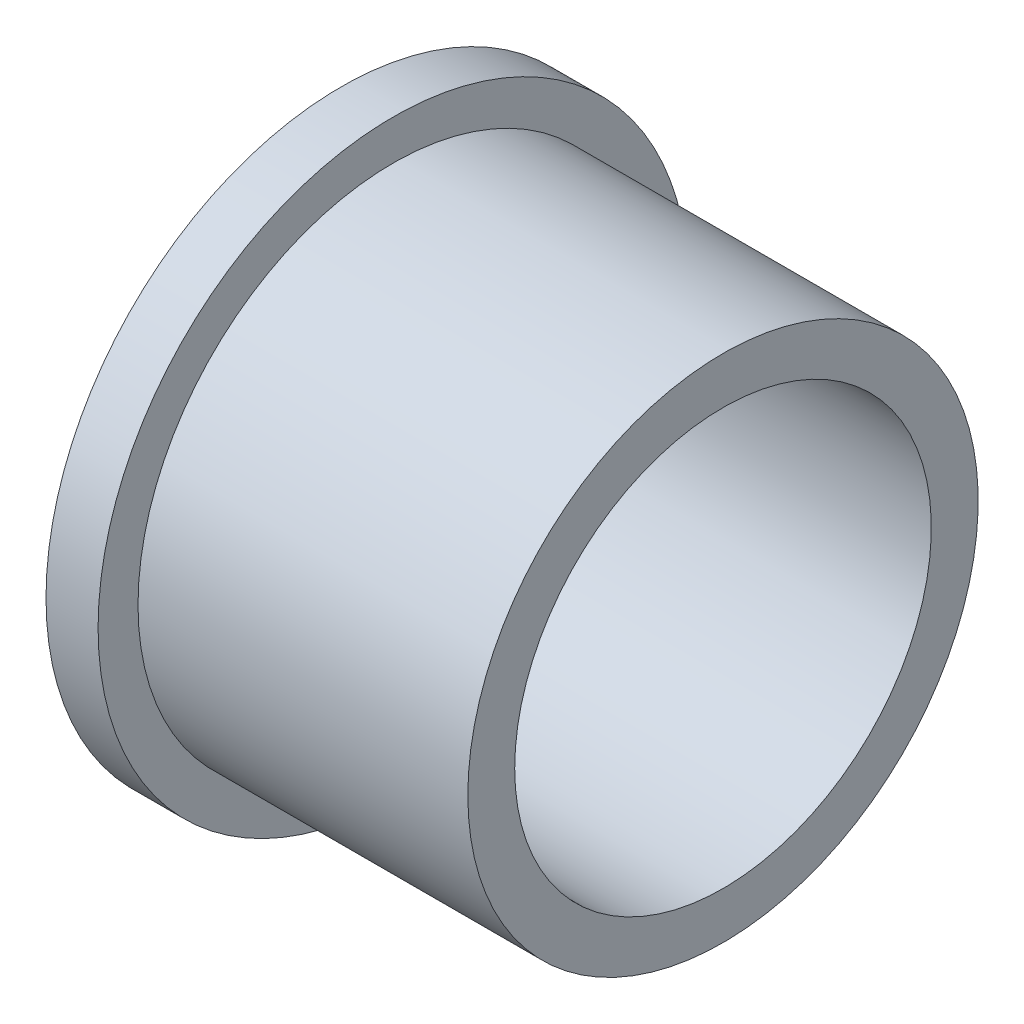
from build123d import *


with BuildPart() as part:
    # Sketch1 → Revolve1 (revolve)
    with BuildSketch(Plane.XY, mode=Mode.PRIVATE) as revolve1_sk:
        Polygon((-1.5, 6), (9.5, 6), (9.5, 7.35), (0, 7.35), (0, 8.5), (-1.5, 8.5), align=None)
    revolve(revolve1_sk.sketch.rotate(Axis((0, 0, 0), (1, 0, 0)), 90), axis=Axis((0, 0, 0), (1, 0, 0)))


solid = part.part
